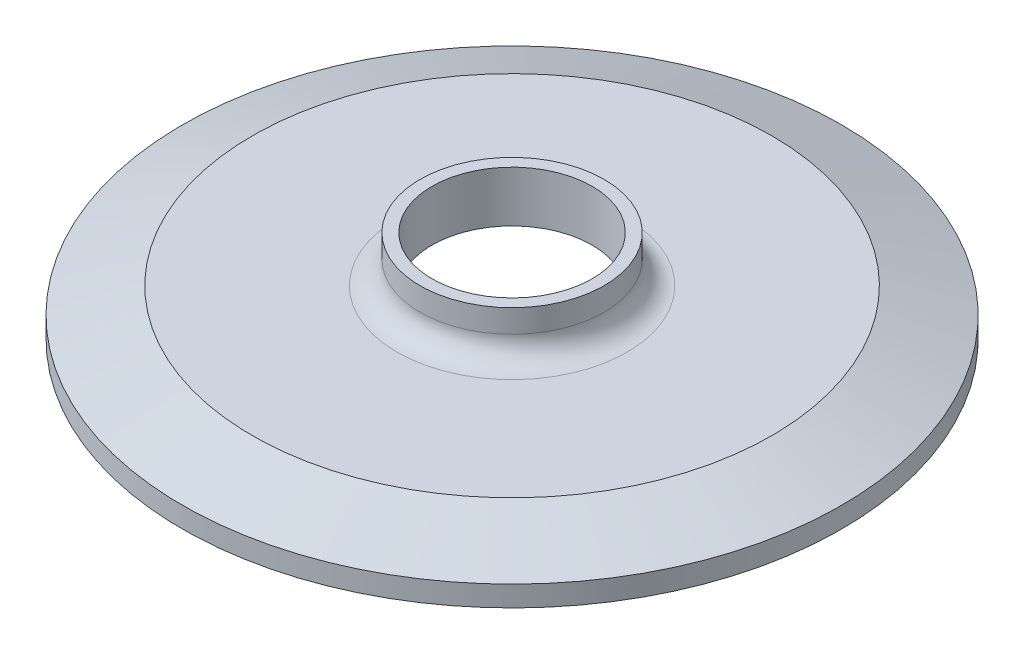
ISO-10303-21;
HEADER;
FILE_DESCRIPTION(('STEP AP214'),'2;1');
FILE_NAME('part.step','',(''),(''),'','','');
FILE_SCHEMA(('AUTOMOTIVE_DESIGN { 1 0 10303 214 1 1 1 1 }'));
ENDSEC;
DATA;
#1=APPLICATION_CONTEXT('core data for automotive mechanical design processes');
#2=APPLICATION_PROTOCOL_DEFINITION('international standard','automotive_design',2000,#1);
#3=PRODUCT_CONTEXT('',#1,'mechanical');
#4=PRODUCT('Part','Part','',(#3));
#5=PRODUCT_RELATED_PRODUCT_CATEGORY('part','',(#4));
#6=PRODUCT_DEFINITION_FORMATION('','',#4);
#7=PRODUCT_DEFINITION_CONTEXT('part definition',#1,'design');
#8=PRODUCT_DEFINITION('design','',#6,#7);
#9=PRODUCT_DEFINITION_SHAPE('','',#8);
#10=(LENGTH_UNIT() NAMED_UNIT(*) SI_UNIT(.MILLI.,.METRE.));
#11=(NAMED_UNIT(*) PLANE_ANGLE_UNIT() SI_UNIT($,.RADIAN.));
#12=(NAMED_UNIT(*) SI_UNIT($,.STERADIAN.) SOLID_ANGLE_UNIT());
#13=UNCERTAINTY_MEASURE_WITH_UNIT(LENGTH_MEASURE(1.E-05),#10,'distance_accuracy_value','');
#14=(GEOMETRIC_REPRESENTATION_CONTEXT(3) GLOBAL_UNCERTAINTY_ASSIGNED_CONTEXT((#13)) GLOBAL_UNIT_ASSIGNED_CONTEXT((#10,
#11,#12)) REPRESENTATION_CONTEXT('',''));
#15=CARTESIAN_POINT('',(0.,0.,0.));
#16=DIRECTION('',(0.,0.,1.));
#17=DIRECTION('',(1.,0.,0.));
#18=AXIS2_PLACEMENT_3D('',#15,#16,#17);
#19=CARTESIAN_POINT('',(-11.049,12.7,0.));
#20=DIRECTION('',(0.,-1.,0.));
#21=DIRECTION('',(0.,0.,-1.));
#22=AXIS2_PLACEMENT_3D('',#19,#20,#21);
#23=PLANE('',#22);
#24=CARTESIAN_POINT('',(0.,12.7,0.));
#25=DIRECTION('',(0.,-1.,0.));
#26=DIRECTION('',(0.,0.,-1.));
#27=AXIS2_PLACEMENT_3D('',#24,#25,#26);
#28=CIRCLE('',#27,12.7);
#29=CARTESIAN_POINT('',(0.,12.7,-12.7));
#30=VERTEX_POINT('',#29);
#31=EDGE_CURVE('E10',#30,#30,#28,.T.);
#32=ORIENTED_EDGE('',*,*,#31,.F.);
#33=EDGE_LOOP('',(#32));
#34=FACE_BOUND('',#33,.T.);
#35=CARTESIAN_POINT('',(0.,12.7,0.));
#36=DIRECTION('',(0.,-1.,0.));
#37=DIRECTION('',(0.,0.,-1.));
#38=AXIS2_PLACEMENT_3D('',#35,#36,#37);
#39=CIRCLE('',#38,11.049);
#40=CARTESIAN_POINT('',(0.,12.7,-11.049));
#41=VERTEX_POINT('',#40);
#42=EDGE_CURVE('E80',#41,#41,#39,.T.);
#43=ORIENTED_EDGE('',*,*,#42,.T.);
#44=EDGE_LOOP('',(#43));
#45=FACE_BOUND('',#44,.T.);
#46=ADVANCED_FACE('F31',(#34,#45),#23,.F.);
#47=CARTESIAN_POINT('',(0.,0.,0.));
#48=DIRECTION('',(0.,-1.,0.));
#49=DIRECTION('',(0.,0.,-1.));
#50=AXIS2_PLACEMENT_3D('',#47,#48,#49);
#51=CYLINDRICAL_SURFACE('',#50,12.7);
#52=CARTESIAN_POINT('',(0.,9.525,0.));
#53=DIRECTION('',(0.,-1.,0.));
#54=DIRECTION('',(0.,0.,-1.));
#55=AXIS2_PLACEMENT_3D('',#52,#53,#54);
#56=CIRCLE('',#55,12.7);
#57=CARTESIAN_POINT('',(0.,9.525,-12.7));
#58=VERTEX_POINT('',#57);
#59=EDGE_CURVE('E37',#58,#58,#56,.T.);
#60=ORIENTED_EDGE('',*,*,#59,.F.);
#61=EDGE_LOOP('',(#60));
#62=FACE_BOUND('',#61,.T.);
#63=ORIENTED_EDGE('',*,*,#31,.T.);
#64=EDGE_LOOP('',(#63));
#65=FACE_BOUND('',#64,.T.);
#66=ADVANCED_FACE('F159',(#62,#65),#51,.T.);
#67=CARTESIAN_POINT('',(0.,9.525,0.));
#68=DIRECTION('',(0.,-1.,0.));
#69=DIRECTION('',(0.,0.,-1.));
#70=AXIS2_PLACEMENT_3D('',#67,#68,#69);
#71=TOROIDAL_SURFACE('',#70,15.875,3.175);
#72=CARTESIAN_POINT('',(0.,6.35,0.));
#73=DIRECTION('',(0.,-1.,0.));
#74=DIRECTION('',(0.,0.,-1.));
#75=AXIS2_PLACEMENT_3D('',#72,#73,#74);
#76=CIRCLE('',#75,15.875);
#77=CARTESIAN_POINT('',(0.,6.35,-15.875));
#78=VERTEX_POINT('',#77);
#79=EDGE_CURVE('E41',#78,#78,#76,.T.);
#80=ORIENTED_EDGE('',*,*,#79,.F.);
#81=EDGE_LOOP('',(#80));
#82=FACE_BOUND('',#81,.T.);
#83=ORIENTED_EDGE('',*,*,#59,.T.);
#84=EDGE_LOOP('',(#83));
#85=FACE_BOUND('',#84,.T.);
#86=ADVANCED_FACE('F154',(#82,#85),#71,.F.);
#87=CARTESIAN_POINT('',(-15.875,6.35,0.));
#88=DIRECTION('',(0.,-1.,0.));
#89=DIRECTION('',(0.,0.,-1.));
#90=AXIS2_PLACEMENT_3D('',#87,#88,#89);
#91=PLANE('',#90);
#92=CARTESIAN_POINT('',(0.,6.35,0.));
#93=DIRECTION('',(0.,-1.,0.));
#94=DIRECTION('',(0.,0.,-1.));
#95=AXIS2_PLACEMENT_3D('',#92,#93,#94);
#96=CIRCLE('',#95,35.8228421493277);
#97=CARTESIAN_POINT('',(0.,6.35,-35.8228421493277));
#98=VERTEX_POINT('',#97);
#99=EDGE_CURVE('E45',#98,#98,#96,.T.);
#100=ORIENTED_EDGE('',*,*,#99,.F.);
#101=EDGE_LOOP('',(#100));
#102=FACE_BOUND('',#101,.T.);
#103=ORIENTED_EDGE('',*,*,#79,.T.);
#104=EDGE_LOOP('',(#103));
#105=FACE_BOUND('',#104,.T.);
#106=ADVANCED_FACE('F148',(#102,#105),#91,.F.);
#107=CARTESIAN_POINT('',(0.,6.35,0.));
#108=DIRECTION('',(0.,-1.,0.));
#109=DIRECTION('',(0.,0.,-1.));
#110=AXIS2_PLACEMENT_3D('',#107,#108,#109);
#111=CONICAL_SURFACE('',#110,35.8228421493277,1.22173047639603);
#112=CARTESIAN_POINT('',(0.,2.8448,0.));
#113=DIRECTION('',(0.,-1.,0.));
#114=DIRECTION('',(0.,0.,-1.));
#115=AXIS2_PLACEMENT_3D('',#112,#113,#114);
#116=CIRCLE('',#115,45.4533);
#117=CARTESIAN_POINT('',(0.,2.8448,-45.4533));
#118=VERTEX_POINT('',#117);
#119=EDGE_CURVE('E50',#118,#118,#116,.T.);
#120=ORIENTED_EDGE('',*,*,#119,.F.);
#121=EDGE_LOOP('',(#120));
#122=FACE_BOUND('',#121,.T.);
#123=ORIENTED_EDGE('',*,*,#99,.T.);
#124=EDGE_LOOP('',(#123));
#125=FACE_BOUND('',#124,.T.);
#126=ADVANCED_FACE('F142',(#122,#125),#111,.T.);
#127=CARTESIAN_POINT('',(0.,0.,0.));
#128=DIRECTION('',(0.,-1.,0.));
#129=DIRECTION('',(0.,0.,-1.));
#130=AXIS2_PLACEMENT_3D('',#127,#128,#129);
#131=CYLINDRICAL_SURFACE('',#130,45.4533);
#132=CARTESIAN_POINT('',(0.,0.,0.));
#133=DIRECTION('',(0.,-1.,0.));
#134=DIRECTION('',(0.,0.,-1.));
#135=AXIS2_PLACEMENT_3D('',#132,#133,#134);
#136=CIRCLE('',#135,45.4533);
#137=CARTESIAN_POINT('',(0.,0.,-45.4533));
#138=VERTEX_POINT('',#137);
#139=EDGE_CURVE('E53',#138,#138,#136,.T.);
#140=ORIENTED_EDGE('',*,*,#139,.F.);
#141=EDGE_LOOP('',(#140));
#142=FACE_BOUND('',#141,.T.);
#143=ORIENTED_EDGE('',*,*,#119,.T.);
#144=EDGE_LOOP('',(#143));
#145=FACE_BOUND('',#144,.T.);
#146=ADVANCED_FACE('F136',(#142,#145),#131,.T.);
#147=CARTESIAN_POINT('',(0.,0.,0.));
#148=DIRECTION('',(0.,-1.,0.));
#149=DIRECTION('',(0.,0.,-1.));
#150=AXIS2_PLACEMENT_3D('',#147,#148,#149);
#151=CONICAL_SURFACE('',#150,45.4533,1.56939586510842);
#152=CARTESIAN_POINT('',(0.,0.00251246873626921,0.));
#153=DIRECTION('',(0.,-1.,0.));
#154=DIRECTION('',(0.,0.,-1.));
#155=AXIS2_PLACEMENT_3D('',#152,#153,#154);
#156=CIRCLE('',#155,43.6592722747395);
#157=CARTESIAN_POINT('',(0.,0.00251246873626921,-43.6592722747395));
#158=VERTEX_POINT('',#157);
#159=EDGE_CURVE('E56',#158,#158,#156,.T.);
#160=ORIENTED_EDGE('',*,*,#159,.F.);
#161=EDGE_LOOP('',(#160));
#162=FACE_BOUND('',#161,.T.);
#163=ORIENTED_EDGE('',*,*,#139,.T.);
#164=EDGE_LOOP('',(#163));
#165=FACE_BOUND('',#164,.T.);
#166=ADVANCED_FACE('F130',(#162,#165),#151,.F.);
#167=CARTESIAN_POINT('',(0.,0.789912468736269,0.));
#168=DIRECTION('',(0.,-1.,0.));
#169=DIRECTION('',(0.,0.,-1.));
#170=AXIS2_PLACEMENT_3D('',#167,#168,#169);
#171=TOROIDAL_SURFACE('',#170,43.6592722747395,0.787399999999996);
#172=CARTESIAN_POINT('',(0.,0.482250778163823,0.));
#173=DIRECTION('',(0.,-1.,0.));
#174=DIRECTION('',(0.,0.,-1.));
#175=AXIS2_PLACEMENT_3D('',#172,#173,#174);
#176=CIRCLE('',#175,42.9344667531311);
#177=CARTESIAN_POINT('',(0.,0.482250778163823,-42.9344667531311));
#178=VERTEX_POINT('',#177);
#179=EDGE_CURVE('E59',#178,#178,#176,.T.);
#180=ORIENTED_EDGE('',*,*,#179,.F.);
#181=EDGE_LOOP('',(#180));
#182=FACE_BOUND('',#181,.T.);
#183=ORIENTED_EDGE('',*,*,#159,.T.);
#184=EDGE_LOOP('',(#183));
#185=FACE_BOUND('',#184,.T.);
#186=ADVANCED_FACE('F124',(#182,#185),#171,.T.);
#187=CARTESIAN_POINT('',(0.,0.482250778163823,0.));
#188=DIRECTION('',(0.,-1.,0.));
#189=DIRECTION('',(0.,0.,-1.));
#190=AXIS2_PLACEMENT_3D('',#187,#188,#189);
#191=CONICAL_SURFACE('',#190,42.9344667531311,0.401425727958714);
#192=CARTESIAN_POINT('',(0.,0.875367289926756,0.));
#193=DIRECTION('',(0.,-1.,0.));
#194=DIRECTION('',(0.,0.,-1.));
#195=AXIS2_PLACEMENT_3D('',#192,#193,#194);
#196=CIRCLE('',#195,42.7675986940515);
#197=CARTESIAN_POINT('',(0.,0.875367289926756,-42.7675986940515));
#198=VERTEX_POINT('',#197);
#199=EDGE_CURVE('E62',#198,#198,#196,.T.);
#200=ORIENTED_EDGE('',*,*,#199,.F.);
#201=EDGE_LOOP('',(#200));
#202=FACE_BOUND('',#201,.T.);
#203=ORIENTED_EDGE('',*,*,#179,.T.);
#204=EDGE_LOOP('',(#203));
#205=FACE_BOUND('',#204,.T.);
#206=ADVANCED_FACE('F118',(#202,#205),#191,.F.);
#207=CARTESIAN_POINT('',(0.,0.408912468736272,0.));
#208=DIRECTION('',(0.,-1.,0.));
#209=DIRECTION('',(0.,0.,-1.));
#210=AXIS2_PLACEMENT_3D('',#207,#208,#209);
#211=TOROIDAL_SURFACE('',#210,41.6687,1.19379999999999);
#212=CARTESIAN_POINT('',(0.,0.875367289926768,0.));
#213=DIRECTION('',(0.,-1.,0.));
#214=DIRECTION('',(0.,0.,-1.));
#215=AXIS2_PLACEMENT_3D('',#212,#213,#214);
#216=CIRCLE('',#215,40.5698013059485);
#217=CARTESIAN_POINT('',(0.,0.875367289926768,-40.5698013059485));
#218=VERTEX_POINT('',#217);
#219=EDGE_CURVE('E65',#218,#218,#216,.T.);
#220=ORIENTED_EDGE('',*,*,#219,.F.);
#221=EDGE_LOOP('',(#220));
#222=FACE_BOUND('',#221,.T.);
#223=ORIENTED_EDGE('',*,*,#199,.T.);
#224=EDGE_LOOP('',(#223));
#225=FACE_BOUND('',#224,.T.);
#226=ADVANCED_FACE('F112',(#222,#225),#211,.F.);
#227=CARTESIAN_POINT('',(0.,0.875367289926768,0.));
#228=DIRECTION('',(0.,1.,0.));
#229=DIRECTION('',(0.,0.,1.));
#230=AXIS2_PLACEMENT_3D('',#227,#228,#229);
#231=CONICAL_SURFACE('',#230,40.5698013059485,0.401425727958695);
#232=CARTESIAN_POINT('',(0.,0.48225077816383,0.));
#233=DIRECTION('',(0.,-1.,0.));
#234=DIRECTION('',(0.,0.,-1.));
#235=AXIS2_PLACEMENT_3D('',#232,#233,#234);
#236=CIRCLE('',#235,40.402933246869);
#237=CARTESIAN_POINT('',(0.,0.48225077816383,-40.402933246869));
#238=VERTEX_POINT('',#237);
#239=EDGE_CURVE('E68',#238,#238,#236,.T.);
#240=ORIENTED_EDGE('',*,*,#239,.F.);
#241=EDGE_LOOP('',(#240));
#242=FACE_BOUND('',#241,.T.);
#243=ORIENTED_EDGE('',*,*,#219,.T.);
#244=EDGE_LOOP('',(#243));
#245=FACE_BOUND('',#244,.T.);
#246=ADVANCED_FACE('F106',(#242,#245),#231,.T.);
#247=CARTESIAN_POINT('',(0.,0.78991246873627,0.));
#248=DIRECTION('',(0.,-1.,0.));
#249=DIRECTION('',(0.,0.,-1.));
#250=AXIS2_PLACEMENT_3D('',#247,#248,#249);
#251=TOROIDAL_SURFACE('',#250,39.6781277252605,0.787399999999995);
#252=CARTESIAN_POINT('',(0.,0.00251246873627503,0.));
#253=DIRECTION('',(0.,-1.,0.));
#254=DIRECTION('',(0.,0.,-1.));
#255=AXIS2_PLACEMENT_3D('',#252,#253,#254);
#256=CIRCLE('',#255,39.6781277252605);
#257=CARTESIAN_POINT('',(0.,0.00251246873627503,-39.6781277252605));
#258=VERTEX_POINT('',#257);
#259=EDGE_CURVE('E71',#258,#258,#256,.T.);
#260=ORIENTED_EDGE('',*,*,#259,.F.);
#261=EDGE_LOOP('',(#260));
#262=FACE_BOUND('',#261,.T.);
#263=ORIENTED_EDGE('',*,*,#239,.T.);
#264=EDGE_LOOP('',(#263));
#265=FACE_BOUND('',#264,.T.);
#266=ADVANCED_FACE('F100',(#262,#265),#251,.T.);
#267=CARTESIAN_POINT('',(0.,0.00251246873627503,0.));
#268=DIRECTION('',(0.,1.,0.));
#269=DIRECTION('',(0.,0.,1.));
#270=AXIS2_PLACEMENT_3D('',#267,#268,#269);
#271=CONICAL_SURFACE('',#270,39.6781277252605,1.57001826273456);
#272=CARTESIAN_POINT('',(0.,0.,0.));
#273=DIRECTION('',(0.,-1.,0.));
#274=DIRECTION('',(0.,0.,-1.));
#275=AXIS2_PLACEMENT_3D('',#272,#273,#274);
#276=CIRCLE('',#275,36.449);
#277=CARTESIAN_POINT('',(0.,0.,-36.449));
#278=VERTEX_POINT('',#277);
#279=EDGE_CURVE('E74',#278,#278,#276,.T.);
#280=ORIENTED_EDGE('',*,*,#279,.F.);
#281=EDGE_LOOP('',(#280));
#282=FACE_BOUND('',#281,.T.);
#283=ORIENTED_EDGE('',*,*,#259,.T.);
#284=EDGE_LOOP('',(#283));
#285=FACE_BOUND('',#284,.T.);
#286=ADVANCED_FACE('F94',(#282,#285),#271,.T.);
#287=CARTESIAN_POINT('',(0.,0.,0.));
#288=DIRECTION('',(0.,-1.,0.));
#289=DIRECTION('',(0.,0.,-1.));
#290=AXIS2_PLACEMENT_3D('',#287,#288,#289);
#291=CONICAL_SURFACE('',#290,36.449,1.35088484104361);
#292=CARTESIAN_POINT('',(0.,5.67757266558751,0.));
#293=DIRECTION('',(0.,-1.,0.));
#294=DIRECTION('',(0.,0.,-1.));
#295=AXIS2_PLACEMENT_3D('',#292,#293,#294);
#296=CIRCLE('',#295,11.049);
#297=CARTESIAN_POINT('',(0.,5.67757266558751,-11.049));
#298=VERTEX_POINT('',#297);
#299=EDGE_CURVE('E77',#298,#298,#296,.T.);
#300=CARTESIAN_POINT('',(0.,5.67757266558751,-11.049));
#301=CARTESIAN_POINT('',(0.,5.61843128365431,-11.3135833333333));
#302=CARTESIAN_POINT('',(0.,5.5592899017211,-11.5781666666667));
#303=CARTESIAN_POINT('',(0.,5.4410071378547,-12.1073333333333));
#304=CARTESIAN_POINT('',(0.,5.38186575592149,-12.3719166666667));
#305=CARTESIAN_POINT('',(0.,5.26358299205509,-12.9010833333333));
#306=CARTESIAN_POINT('',(0.,5.20444161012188,-13.1656666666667));
#307=CARTESIAN_POINT('',(0.,5.08615884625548,-13.6948333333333));
#308=CARTESIAN_POINT('',(0.,5.02701746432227,-13.9594166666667));
#309=CARTESIAN_POINT('',(0.,4.90873470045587,-14.4885833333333));
#310=CARTESIAN_POINT('',(0.,4.84959331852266,-14.7531666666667));
#311=CARTESIAN_POINT('',(0.,4.73131055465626,-15.2823333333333));
#312=CARTESIAN_POINT('',(0.,4.67216917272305,-15.5469166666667));
#313=CARTESIAN_POINT('',(0.,4.55388640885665,-16.0760833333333));
#314=CARTESIAN_POINT('',(0.,4.49474502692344,-16.3406666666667));
#315=CARTESIAN_POINT('',(0.,4.37646226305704,-16.8698333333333));
#316=CARTESIAN_POINT('',(0.,4.31732088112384,-17.1344166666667));
#317=CARTESIAN_POINT('',(0.,4.19903811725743,-17.6635833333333));
#318=CARTESIAN_POINT('',(0.,4.13989673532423,-17.9281666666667));
#319=CARTESIAN_POINT('',(0.,4.02161397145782,-18.4573333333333));
#320=CARTESIAN_POINT('',(0.,3.96247258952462,-18.7219166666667));
#321=CARTESIAN_POINT('',(0.,3.84418982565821,-19.2510833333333));
#322=CARTESIAN_POINT('',(0.,3.78504844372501,-19.5156666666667));
#323=CARTESIAN_POINT('',(0.,3.6667656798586,-20.0448333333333));
#324=CARTESIAN_POINT('',(0.,3.6076242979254,-20.3094166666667));
#325=CARTESIAN_POINT('',(0.,3.48934153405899,-20.8385833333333));
#326=CARTESIAN_POINT('',(0.,3.43020015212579,-21.1031666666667));
#327=CARTESIAN_POINT('',(0.,3.31191738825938,-21.6323333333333));
#328=CARTESIAN_POINT('',(0.,3.25277600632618,-21.8969166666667));
#329=CARTESIAN_POINT('',(0.,3.13449324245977,-22.4260833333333));
#330=CARTESIAN_POINT('',(0.,3.07535186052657,-22.6906666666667));
#331=CARTESIAN_POINT('',(0.,2.95706909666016,-23.2198333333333));
#332=CARTESIAN_POINT('',(0.,2.89792771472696,-23.4844166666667));
#333=CARTESIAN_POINT('',(0.,2.77964495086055,-24.0135833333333));
#334=CARTESIAN_POINT('',(0.,2.72050356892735,-24.2781666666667));
#335=CARTESIAN_POINT('',(0.,2.60222080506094,-24.8073333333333));
#336=CARTESIAN_POINT('',(0.,2.54307942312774,-25.0719166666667));
#337=CARTESIAN_POINT('',(0.,2.42479665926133,-25.6010833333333));
#338=CARTESIAN_POINT('',(0.,2.36565527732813,-25.8656666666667));
#339=CARTESIAN_POINT('',(0.,2.24737251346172,-26.3948333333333));
#340=CARTESIAN_POINT('',(0.,2.18823113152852,-26.6594166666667));
#341=CARTESIAN_POINT('',(0.,2.06994836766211,-27.1885833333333));
#342=CARTESIAN_POINT('',(0.,2.01080698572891,-27.4531666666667));
#343=CARTESIAN_POINT('',(0.,1.8925242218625,-27.9823333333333));
#344=CARTESIAN_POINT('',(0.,1.8333828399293,-28.2469166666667));
#345=CARTESIAN_POINT('',(0.,1.71510007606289,-28.7760833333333));
#346=CARTESIAN_POINT('',(0.,1.65595869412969,-29.0406666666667));
#347=CARTESIAN_POINT('',(0.,1.53767593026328,-29.5698333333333));
#348=CARTESIAN_POINT('',(0.,1.47853454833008,-29.8344166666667));
#349=CARTESIAN_POINT('',(0.,1.36025178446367,-30.3635833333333));
#350=CARTESIAN_POINT('',(0.,1.30111040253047,-30.6281666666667));
#351=CARTESIAN_POINT('',(0.,1.18282763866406,-31.1573333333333));
#352=CARTESIAN_POINT('',(0.,1.12368625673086,-31.4219166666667));
#353=CARTESIAN_POINT('',(0.,1.00540349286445,-31.9510833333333));
#354=CARTESIAN_POINT('',(0.,0.946262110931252,-32.2156666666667));
#355=CARTESIAN_POINT('',(0.,0.827979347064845,-32.7448333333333));
#356=CARTESIAN_POINT('',(0.,0.768837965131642,-33.0094166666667));
#357=CARTESIAN_POINT('',(0.,0.650555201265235,-33.5385833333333));
#358=CARTESIAN_POINT('',(0.,0.591413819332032,-33.8031666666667));
#359=CARTESIAN_POINT('',(0.,0.473131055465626,-34.3323333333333));
#360=CARTESIAN_POINT('',(0.,0.413989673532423,-34.5969166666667));
#361=CARTESIAN_POINT('',(0.,0.295706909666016,-35.1260833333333));
#362=CARTESIAN_POINT('',(0.,0.236565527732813,-35.3906666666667));
#363=CARTESIAN_POINT('',(0.,0.118282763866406,-35.9198333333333));
#364=CARTESIAN_POINT('',(0.,0.059141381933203,-36.1844166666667));
#365=CARTESIAN_POINT('',(0.,0.,-36.449));
#366=B_SPLINE_CURVE_WITH_KNOTS('',3,(#300,#301,#302,#303,#304,#305,#306,#307,#308,#309,#310,
#311,#312,#313,#314,#315,#316,#317,#318,#319,#320,#321,#322,#323,#324,#325,#326,#327,#328,#329,
#330,#331,#332,#333,#334,#335,#336,#337,#338,#339,#340,#341,#342,#343,#344,#345,#346,#347,#348,
#349,#350,#351,#352,#353,#354,#355,#356,#357,#358,#359,#360,#361,#362,#363,#364,#365),
.UNSPECIFIED.,.F.,.F.,(4,2,2,2,2,2,2,2,2,2,2,2,2,2,2,2,2,2,2,2,2,2,2,2,2,2,2,2,2,2,2,2,4),(0.,
0.81333780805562,1.62667561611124,2.44001342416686,3.25335123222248,4.0666890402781,
4.88002684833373,5.69336465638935,6.50670246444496,7.32004027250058,8.1333780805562,
8.94671588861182,9.76005369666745,10.5733915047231,11.3867293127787,12.2000671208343,
13.0134049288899,13.8267427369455,14.6400805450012,15.4534183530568,16.2667561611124,
17.080093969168,17.8934317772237,18.7067695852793,19.5201073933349,20.3334452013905,
21.1467830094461,21.9601208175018,22.7734586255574,23.586796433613,24.4001342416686,
25.2134720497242,26.0268098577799),.UNSPECIFIED.);
#367=EDGE_CURVE('BSEAM88',#298,#278,#366,.T.);
#368=ORIENTED_EDGE('',*,*,#299,.F.);
#369=ORIENTED_EDGE('',*,*,#279,.T.);
#370=ORIENTED_EDGE('',*,*,#367,.T.);
#371=ORIENTED_EDGE('',*,*,#367,.F.);
#372=EDGE_LOOP('',(#368,#370,#369,#371));
#373=FACE_BOUND('',#372,.T.);
#374=ADVANCED_FACE('F88',(#373),#291,.F.);
#375=CARTESIAN_POINT('',(0.,0.,0.));
#376=DIRECTION('',(0.,-1.,0.));
#377=DIRECTION('',(0.,0.,-1.));
#378=AXIS2_PLACEMENT_3D('',#375,#376,#377);
#379=CYLINDRICAL_SURFACE('',#378,11.049);
#380=ORIENTED_EDGE('',*,*,#42,.F.);
#381=EDGE_LOOP('',(#380));
#382=FACE_BOUND('',#381,.T.);
#383=ORIENTED_EDGE('',*,*,#299,.T.);
#384=EDGE_LOOP('',(#383));
#385=FACE_BOUND('',#384,.T.);
#386=ADVANCED_FACE('F85',(#382,#385),#379,.F.);
#387=CLOSED_SHELL('',(#46,#66,#86,#106,#126,#146,#166,#186,#206,#226,#246,#266,#286,#374,#386));
#388=MANIFOLD_SOLID_BREP('B2',#387);
#389=ADVANCED_BREP_SHAPE_REPRESENTATION('',(#18,#388),#14);
#390=SHAPE_DEFINITION_REPRESENTATION(#9,#389);
ENDSEC;
END-ISO-10303-21;
